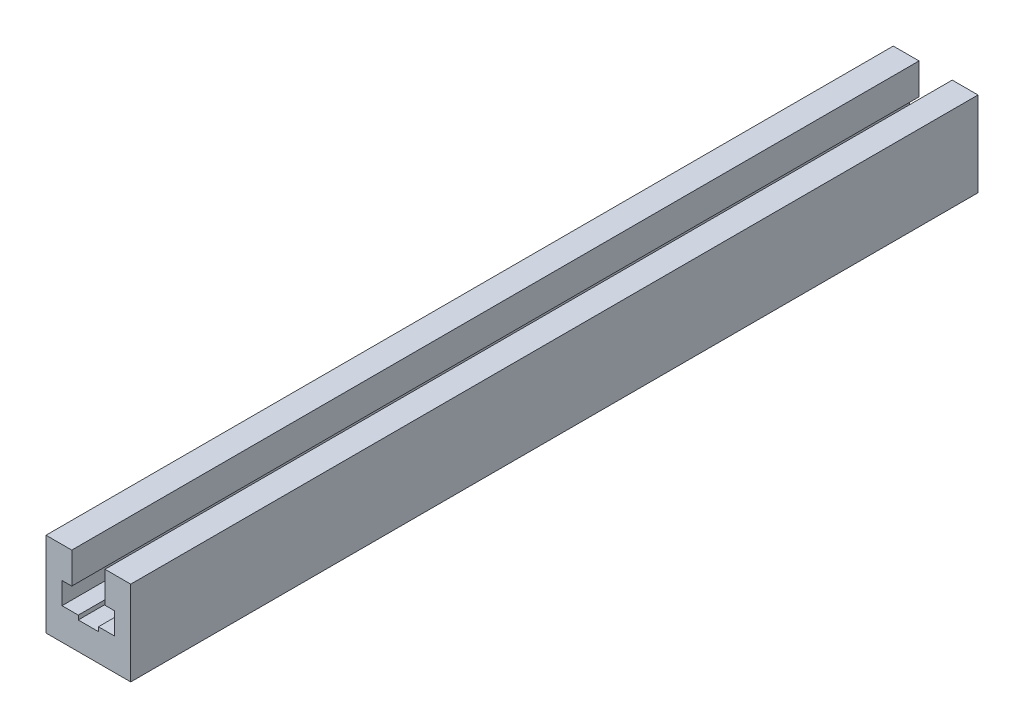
ISO-10303-21;
HEADER;
FILE_DESCRIPTION(('STEP AP214'),'2;1');
FILE_NAME('part.step','',(''),(''),'','','');
FILE_SCHEMA(('AUTOMOTIVE_DESIGN { 1 0 10303 214 1 1 1 1 }'));
ENDSEC;
DATA;
#1=APPLICATION_CONTEXT('core data for automotive mechanical design processes');
#2=APPLICATION_PROTOCOL_DEFINITION('international standard','automotive_design',2000,#1);
#3=PRODUCT_CONTEXT('',#1,'mechanical');
#4=PRODUCT('Part','Part','',(#3));
#5=PRODUCT_RELATED_PRODUCT_CATEGORY('part','',(#4));
#6=PRODUCT_DEFINITION_FORMATION('','',#4);
#7=PRODUCT_DEFINITION_CONTEXT('part definition',#1,'design');
#8=PRODUCT_DEFINITION('design','',#6,#7);
#9=PRODUCT_DEFINITION_SHAPE('','',#8);
#10=(LENGTH_UNIT() NAMED_UNIT(*) SI_UNIT(.MILLI.,.METRE.));
#11=(NAMED_UNIT(*) PLANE_ANGLE_UNIT() SI_UNIT($,.RADIAN.));
#12=(NAMED_UNIT(*) SI_UNIT($,.STERADIAN.) SOLID_ANGLE_UNIT());
#13=UNCERTAINTY_MEASURE_WITH_UNIT(LENGTH_MEASURE(1.E-05),#10,'distance_accuracy_value','');
#14=(GEOMETRIC_REPRESENTATION_CONTEXT(3) GLOBAL_UNCERTAINTY_ASSIGNED_CONTEXT((#13)) GLOBAL_UNIT_ASSIGNED_CONTEXT((#10,
#11,#12)) REPRESENTATION_CONTEXT('',''));
#15=CARTESIAN_POINT('',(0.,0.,0.));
#16=DIRECTION('',(0.,0.,1.));
#17=DIRECTION('',(1.,0.,0.));
#18=AXIS2_PLACEMENT_3D('',#15,#16,#17);
#19=CARTESIAN_POINT('',(-15.55,18.7,0.));
#20=DIRECTION('',(0.,-1.,0.));
#21=DIRECTION('',(0.,0.,-1.));
#22=AXIS2_PLACEMENT_3D('',#19,#20,#21);
#23=PLANE('',#22);
#24=DIRECTION('',(1.,0.,0.));
#25=VECTOR('',#24,1.);
#26=CARTESIAN_POINT('',(-15.55,18.7,500.));
#27=LINE('',#26,#25);
#28=CARTESIAN_POINT('',(-15.55,18.7,500.));
#29=VERTEX_POINT('',#28);
#30=CARTESIAN_POINT('',(-5.95,18.7,500.));
#31=VERTEX_POINT('',#30);
#32=EDGE_CURVE('E183',#29,#31,#27,.T.);
#33=ORIENTED_EDGE('',*,*,#32,.T.);
#34=DIRECTION('',(0.,0.,1.));
#35=VECTOR('',#34,1.);
#36=CARTESIAN_POINT('',(-5.95,18.7,0.));
#37=LINE('',#36,#35);
#38=CARTESIAN_POINT('',(-5.95,18.7,0.));
#39=VERTEX_POINT('',#38);
#40=EDGE_CURVE('E155',#39,#31,#37,.T.);
#41=ORIENTED_EDGE('',*,*,#40,.F.);
#42=DIRECTION('',(1.,0.,0.));
#43=VECTOR('',#42,1.);
#44=CARTESIAN_POINT('',(-15.55,18.7,0.));
#45=LINE('',#44,#43);
#46=CARTESIAN_POINT('',(-15.55,18.7,0.));
#47=VERTEX_POINT('',#46);
#48=EDGE_CURVE('E146',#47,#39,#45,.T.);
#49=ORIENTED_EDGE('',*,*,#48,.F.);
#50=DIRECTION('',(0.,0.,1.));
#51=VECTOR('',#50,1.);
#52=CARTESIAN_POINT('',(-15.55,18.7,0.));
#53=LINE('',#52,#51);
#54=EDGE_CURVE('E247',#47,#29,#53,.T.);
#55=ORIENTED_EDGE('',*,*,#54,.T.);
#56=EDGE_LOOP('',(#33,#41,#49,#55));
#57=FACE_BOUND('',#56,.T.);
#58=ADVANCED_FACE('F14',(#57),#23,.F.);
#59=CARTESIAN_POINT('',(-25.,50.,0.));
#60=DIRECTION('',(-1.,0.,0.));
#61=DIRECTION('',(0.,0.,1.));
#62=AXIS2_PLACEMENT_3D('',#59,#60,#61);
#63=PLANE('',#62);
#64=DIRECTION('',(0.,0.,1.));
#65=VECTOR('',#64,1.);
#66=CARTESIAN_POINT('',(-25.,50.,0.));
#67=LINE('',#66,#65);
#68=CARTESIAN_POINT('',(-25.,50.,0.));
#69=VERTEX_POINT('',#68);
#70=CARTESIAN_POINT('',(-25.,50.,500.));
#71=VERTEX_POINT('',#70);
#72=EDGE_CURVE('E9',#69,#71,#67,.T.);
#73=ORIENTED_EDGE('',*,*,#72,.F.);
#74=DIRECTION('',(0.,-1.,0.));
#75=VECTOR('',#74,1.);
#76=CARTESIAN_POINT('',(-25.,50.,0.));
#77=LINE('',#76,#75);
#78=CARTESIAN_POINT('',(-25.,0.,0.));
#79=VERTEX_POINT('',#78);
#80=EDGE_CURVE('E198',#69,#79,#77,.T.);
#81=ORIENTED_EDGE('',*,*,#80,.T.);
#82=DIRECTION('',(0.,0.,1.));
#83=VECTOR('',#82,1.);
#84=CARTESIAN_POINT('',(-25.,0.,0.));
#85=LINE('',#84,#83);
#86=CARTESIAN_POINT('',(-25.,0.,500.));
#87=VERTEX_POINT('',#86);
#88=EDGE_CURVE('E232',#79,#87,#85,.T.);
#89=ORIENTED_EDGE('',*,*,#88,.T.);
#90=DIRECTION('',(0.,-1.,0.));
#91=VECTOR('',#90,1.);
#92=CARTESIAN_POINT('',(-25.,50.,500.));
#93=LINE('',#92,#91);
#94=EDGE_CURVE('E157',#71,#87,#93,.T.);
#95=ORIENTED_EDGE('',*,*,#94,.F.);
#96=EDGE_LOOP('',(#73,#81,#89,#95));
#97=FACE_BOUND('',#96,.T.);
#98=ADVANCED_FACE('F262',(#97),#63,.T.);
#99=CARTESIAN_POINT('',(-25.,50.,0.));
#100=DIRECTION('',(0.,-1.,0.));
#101=DIRECTION('',(0.,0.,-1.));
#102=AXIS2_PLACEMENT_3D('',#99,#100,#101);
#103=PLANE('',#102);
#104=DIRECTION('',(0.,0.,1.));
#105=VECTOR('',#104,1.);
#106=CARTESIAN_POINT('',(-9.8,50.,0.));
#107=LINE('',#106,#105);
#108=CARTESIAN_POINT('',(-9.8,50.,0.));
#109=VERTEX_POINT('',#108);
#110=CARTESIAN_POINT('',(-9.8,50.,500.));
#111=VERTEX_POINT('',#110);
#112=EDGE_CURVE('E22',#109,#111,#107,.T.);
#113=ORIENTED_EDGE('',*,*,#112,.F.);
#114=DIRECTION('',(1.,0.,0.));
#115=VECTOR('',#114,1.);
#116=CARTESIAN_POINT('',(-25.,50.,0.));
#117=LINE('',#116,#115);
#118=EDGE_CURVE('E229',#69,#109,#117,.T.);
#119=ORIENTED_EDGE('',*,*,#118,.F.);
#120=ORIENTED_EDGE('',*,*,#72,.T.);
#121=DIRECTION('',(1.,0.,0.));
#122=VECTOR('',#121,1.);
#123=CARTESIAN_POINT('',(-25.,50.,500.));
#124=LINE('',#123,#122);
#125=EDGE_CURVE('E195',#71,#111,#124,.T.);
#126=ORIENTED_EDGE('',*,*,#125,.T.);
#127=EDGE_LOOP('',(#113,#119,#120,#126));
#128=FACE_BOUND('',#127,.T.);
#129=ADVANCED_FACE('F16',(#128),#103,.F.);
#130=CARTESIAN_POINT('',(-9.8,31.6,0.));
#131=DIRECTION('',(1.,0.,0.));
#132=DIRECTION('',(0.,0.,-1.));
#133=AXIS2_PLACEMENT_3D('',#130,#131,#132);
#134=PLANE('',#133);
#135=DIRECTION('',(0.,0.,1.));
#136=VECTOR('',#135,1.);
#137=CARTESIAN_POINT('',(-9.8,31.6,0.));
#138=LINE('',#137,#136);
#139=CARTESIAN_POINT('',(-9.8,31.6,0.));
#140=VERTEX_POINT('',#139);
#141=CARTESIAN_POINT('',(-9.8,31.6,500.));
#142=VERTEX_POINT('',#141);
#143=EDGE_CURVE('E251',#140,#142,#138,.T.);
#144=ORIENTED_EDGE('',*,*,#143,.F.);
#145=DIRECTION('',(0.,1.,0.));
#146=VECTOR('',#145,1.);
#147=CARTESIAN_POINT('',(-9.8,31.6,0.));
#148=LINE('',#147,#146);
#149=EDGE_CURVE('E226',#140,#109,#148,.T.);
#150=ORIENTED_EDGE('',*,*,#149,.T.);
#151=ORIENTED_EDGE('',*,*,#112,.T.);
#152=DIRECTION('',(0.,1.,0.));
#153=VECTOR('',#152,1.);
#154=CARTESIAN_POINT('',(-9.8,31.6,500.));
#155=LINE('',#154,#153);
#156=EDGE_CURVE('E192',#142,#111,#155,.T.);
#157=ORIENTED_EDGE('',*,*,#156,.F.);
#158=EDGE_LOOP('',(#144,#150,#151,#157));
#159=FACE_BOUND('',#158,.T.);
#160=ADVANCED_FACE('F254',(#159),#134,.T.);
#161=CARTESIAN_POINT('',(-15.55,31.6,0.));
#162=DIRECTION('',(0.,-1.,0.));
#163=DIRECTION('',(0.,0.,-1.));
#164=AXIS2_PLACEMENT_3D('',#161,#162,#163);
#165=PLANE('',#164);
#166=DIRECTION('',(0.,0.,1.));
#167=VECTOR('',#166,1.);
#168=CARTESIAN_POINT('',(-15.55,31.6,0.));
#169=LINE('',#168,#167);
#170=CARTESIAN_POINT('',(-15.55,31.6,0.));
#171=VERTEX_POINT('',#170);
#172=CARTESIAN_POINT('',(-15.55,31.6,500.));
#173=VERTEX_POINT('',#172);
#174=EDGE_CURVE('E249',#171,#173,#169,.T.);
#175=ORIENTED_EDGE('',*,*,#174,.F.);
#176=DIRECTION('',(1.,0.,0.));
#177=VECTOR('',#176,1.);
#178=CARTESIAN_POINT('',(-15.55,31.6,0.));
#179=LINE('',#178,#177);
#180=EDGE_CURVE('E223',#171,#140,#179,.T.);
#181=ORIENTED_EDGE('',*,*,#180,.T.);
#182=ORIENTED_EDGE('',*,*,#143,.T.);
#183=DIRECTION('',(1.,0.,0.));
#184=VECTOR('',#183,1.);
#185=CARTESIAN_POINT('',(-15.55,31.6,500.));
#186=LINE('',#185,#184);
#187=EDGE_CURVE('E189',#173,#142,#186,.T.);
#188=ORIENTED_EDGE('',*,*,#187,.F.);
#189=EDGE_LOOP('',(#175,#181,#182,#188));
#190=FACE_BOUND('',#189,.T.);
#191=ADVANCED_FACE('F297',(#190),#165,.T.);
#192=CARTESIAN_POINT('',(-15.55,18.7,0.));
#193=DIRECTION('',(1.,0.,0.));
#194=DIRECTION('',(0.,0.,-1.));
#195=AXIS2_PLACEMENT_3D('',#192,#193,#194);
#196=PLANE('',#195);
#197=ORIENTED_EDGE('',*,*,#54,.F.);
#198=DIRECTION('',(0.,1.,0.));
#199=VECTOR('',#198,1.);
#200=CARTESIAN_POINT('',(-15.55,18.7,0.));
#201=LINE('',#200,#199);
#202=EDGE_CURVE('E220',#47,#171,#201,.T.);
#203=ORIENTED_EDGE('',*,*,#202,.T.);
#204=ORIENTED_EDGE('',*,*,#174,.T.);
#205=DIRECTION('',(0.,1.,0.));
#206=VECTOR('',#205,1.);
#207=CARTESIAN_POINT('',(-15.55,18.7,500.));
#208=LINE('',#207,#206);
#209=EDGE_CURVE('E186',#29,#173,#208,.T.);
#210=ORIENTED_EDGE('',*,*,#209,.F.);
#211=EDGE_LOOP('',(#197,#203,#204,#210));
#212=FACE_BOUND('',#211,.T.);
#213=ADVANCED_FACE('F300',(#212),#196,.T.);
#214=CARTESIAN_POINT('',(5.95,18.7,0.));
#215=VERTEX_POINT('',#214);
#216=CARTESIAN_POINT('',(15.55,18.7,0.));
#217=VERTEX_POINT('',#216);
#218=EDGE_CURVE('E218',#215,#217,#45,.T.);
#219=ORIENTED_EDGE('',*,*,#218,.F.);
#220=DIRECTION('',(0.,0.,1.));
#221=VECTOR('',#220,1.);
#222=CARTESIAN_POINT('',(5.95,18.7,0.));
#223=LINE('',#222,#221);
#224=CARTESIAN_POINT('',(5.95,18.7,500.));
#225=VERTEX_POINT('',#224);
#226=EDGE_CURVE('E158',#215,#225,#223,.T.);
#227=ORIENTED_EDGE('',*,*,#226,.T.);
#228=CARTESIAN_POINT('',(15.55,18.7,500.));
#229=VERTEX_POINT('',#228);
#230=EDGE_CURVE('E182',#225,#229,#27,.T.);
#231=ORIENTED_EDGE('',*,*,#230,.T.);
#232=DIRECTION('',(0.,0.,1.));
#233=VECTOR('',#232,1.);
#234=CARTESIAN_POINT('',(15.55,18.7,0.));
#235=LINE('',#234,#233);
#236=EDGE_CURVE('E244',#217,#229,#235,.T.);
#237=ORIENTED_EDGE('',*,*,#236,.F.);
#238=EDGE_LOOP('',(#219,#227,#231,#237));
#239=FACE_BOUND('',#238,.T.);
#240=ADVANCED_FACE('F292',(#239),#23,.F.);
#241=CARTESIAN_POINT('',(15.55,18.7,0.));
#242=DIRECTION('',(1.,0.,0.));
#243=DIRECTION('',(0.,1.,0.));
#244=AXIS2_PLACEMENT_3D('',#241,#242,#243);
#245=PLANE('',#244);
#246=DIRECTION('',(0.,0.,1.));
#247=VECTOR('',#246,1.);
#248=CARTESIAN_POINT('',(15.55,31.6,0.));
#249=LINE('',#248,#247);
#250=CARTESIAN_POINT('',(15.55,31.6,0.));
#251=VERTEX_POINT('',#250);
#252=CARTESIAN_POINT('',(15.55,31.6,500.));
#253=VERTEX_POINT('',#252);
#254=EDGE_CURVE('E242',#251,#253,#249,.T.);
#255=ORIENTED_EDGE('',*,*,#254,.F.);
#256=DIRECTION('',(0.,1.,0.));
#257=VECTOR('',#256,1.);
#258=CARTESIAN_POINT('',(15.55,18.7,0.));
#259=LINE('',#258,#257);
#260=EDGE_CURVE('E215',#217,#251,#259,.T.);
#261=ORIENTED_EDGE('',*,*,#260,.F.);
#262=ORIENTED_EDGE('',*,*,#236,.T.);
#263=DIRECTION('',(0.,1.,0.));
#264=VECTOR('',#263,1.);
#265=CARTESIAN_POINT('',(15.55,18.7,500.));
#266=LINE('',#265,#264);
#267=EDGE_CURVE('E179',#229,#253,#266,.T.);
#268=ORIENTED_EDGE('',*,*,#267,.T.);
#269=EDGE_LOOP('',(#255,#261,#262,#268));
#270=FACE_BOUND('',#269,.T.);
#271=ADVANCED_FACE('F286',(#270),#245,.F.);
#272=CARTESIAN_POINT('',(9.8,31.6,0.));
#273=DIRECTION('',(0.,-1.,0.));
#274=DIRECTION('',(0.,0.,-1.));
#275=AXIS2_PLACEMENT_3D('',#272,#273,#274);
#276=PLANE('',#275);
#277=DIRECTION('',(0.,0.,1.));
#278=VECTOR('',#277,1.);
#279=CARTESIAN_POINT('',(9.8,31.6,0.));
#280=LINE('',#279,#278);
#281=CARTESIAN_POINT('',(9.8,31.6,0.));
#282=VERTEX_POINT('',#281);
#283=CARTESIAN_POINT('',(9.8,31.6,500.));
#284=VERTEX_POINT('',#283);
#285=EDGE_CURVE('E240',#282,#284,#280,.T.);
#286=ORIENTED_EDGE('',*,*,#285,.F.);
#287=DIRECTION('',(1.,0.,0.));
#288=VECTOR('',#287,1.);
#289=CARTESIAN_POINT('',(9.8,31.6,0.));
#290=LINE('',#289,#288);
#291=EDGE_CURVE('E212',#282,#251,#290,.T.);
#292=ORIENTED_EDGE('',*,*,#291,.T.);
#293=ORIENTED_EDGE('',*,*,#254,.T.);
#294=DIRECTION('',(1.,0.,0.));
#295=VECTOR('',#294,1.);
#296=CARTESIAN_POINT('',(9.8,31.6,500.));
#297=LINE('',#296,#295);
#298=EDGE_CURVE('E176',#284,#253,#297,.T.);
#299=ORIENTED_EDGE('',*,*,#298,.F.);
#300=EDGE_LOOP('',(#286,#292,#293,#299));
#301=FACE_BOUND('',#300,.T.);
#302=ADVANCED_FACE('F283',(#301),#276,.T.);
#303=CARTESIAN_POINT('',(9.8,31.6,0.));
#304=DIRECTION('',(1.,0.,0.));
#305=DIRECTION('',(0.,0.,-1.));
#306=AXIS2_PLACEMENT_3D('',#303,#304,#305);
#307=PLANE('',#306);
#308=DIRECTION('',(0.,0.,1.));
#309=VECTOR('',#308,1.);
#310=CARTESIAN_POINT('',(9.8,50.,0.));
#311=LINE('',#310,#309);
#312=CARTESIAN_POINT('',(9.8,50.,0.));
#313=VERTEX_POINT('',#312);
#314=CARTESIAN_POINT('',(9.8,50.,500.));
#315=VERTEX_POINT('',#314);
#316=EDGE_CURVE('E238',#313,#315,#311,.T.);
#317=ORIENTED_EDGE('',*,*,#316,.F.);
#318=DIRECTION('',(0.,1.,0.));
#319=VECTOR('',#318,1.);
#320=CARTESIAN_POINT('',(9.8,31.6,0.));
#321=LINE('',#320,#319);
#322=EDGE_CURVE('E209',#282,#313,#321,.T.);
#323=ORIENTED_EDGE('',*,*,#322,.F.);
#324=ORIENTED_EDGE('',*,*,#285,.T.);
#325=DIRECTION('',(0.,1.,0.));
#326=VECTOR('',#325,1.);
#327=CARTESIAN_POINT('',(9.8,31.6,500.));
#328=LINE('',#327,#326);
#329=EDGE_CURVE('E173',#284,#315,#328,.T.);
#330=ORIENTED_EDGE('',*,*,#329,.T.);
#331=EDGE_LOOP('',(#317,#323,#324,#330));
#332=FACE_BOUND('',#331,.T.);
#333=ADVANCED_FACE('F278',(#332),#307,.F.);
#334=CARTESIAN_POINT('',(9.8,50.,0.));
#335=DIRECTION('',(0.,-1.,0.));
#336=DIRECTION('',(0.,0.,-1.));
#337=AXIS2_PLACEMENT_3D('',#334,#335,#336);
#338=PLANE('',#337);
#339=DIRECTION('',(0.,0.,1.));
#340=VECTOR('',#339,1.);
#341=CARTESIAN_POINT('',(25.,50.,0.));
#342=LINE('',#341,#340);
#343=CARTESIAN_POINT('',(25.,50.,0.));
#344=VERTEX_POINT('',#343);
#345=CARTESIAN_POINT('',(25.,50.,500.));
#346=VERTEX_POINT('',#345);
#347=EDGE_CURVE('E236',#344,#346,#342,.T.);
#348=ORIENTED_EDGE('',*,*,#347,.F.);
#349=DIRECTION('',(1.,0.,0.));
#350=VECTOR('',#349,1.);
#351=CARTESIAN_POINT('',(9.8,50.,0.));
#352=LINE('',#351,#350);
#353=EDGE_CURVE('E206',#313,#344,#352,.T.);
#354=ORIENTED_EDGE('',*,*,#353,.F.);
#355=ORIENTED_EDGE('',*,*,#316,.T.);
#356=DIRECTION('',(1.,0.,0.));
#357=VECTOR('',#356,1.);
#358=CARTESIAN_POINT('',(9.8,50.,500.));
#359=LINE('',#358,#357);
#360=EDGE_CURVE('E170',#315,#346,#359,.T.);
#361=ORIENTED_EDGE('',*,*,#360,.T.);
#362=EDGE_LOOP('',(#348,#354,#355,#361));
#363=FACE_BOUND('',#362,.T.);
#364=ADVANCED_FACE('F274',(#363),#338,.F.);
#365=CARTESIAN_POINT('',(25.,50.,0.));
#366=DIRECTION('',(-1.,0.,0.));
#367=DIRECTION('',(0.,0.,1.));
#368=AXIS2_PLACEMENT_3D('',#365,#366,#367);
#369=PLANE('',#368);
#370=DIRECTION('',(0.,0.,1.));
#371=VECTOR('',#370,1.);
#372=CARTESIAN_POINT('',(25.,0.,0.));
#373=LINE('',#372,#371);
#374=CARTESIAN_POINT('',(25.,0.,0.));
#375=VERTEX_POINT('',#374);
#376=CARTESIAN_POINT('',(25.,0.,500.));
#377=VERTEX_POINT('',#376);
#378=EDGE_CURVE('E234',#375,#377,#373,.T.);
#379=ORIENTED_EDGE('',*,*,#378,.F.);
#380=DIRECTION('',(0.,-1.,0.));
#381=VECTOR('',#380,1.);
#382=CARTESIAN_POINT('',(25.,50.,0.));
#383=LINE('',#382,#381);
#384=EDGE_CURVE('E203',#344,#375,#383,.T.);
#385=ORIENTED_EDGE('',*,*,#384,.F.);
#386=ORIENTED_EDGE('',*,*,#347,.T.);
#387=DIRECTION('',(0.,-1.,0.));
#388=VECTOR('',#387,1.);
#389=CARTESIAN_POINT('',(25.,50.,500.));
#390=LINE('',#389,#388);
#391=EDGE_CURVE('E167',#346,#377,#390,.T.);
#392=ORIENTED_EDGE('',*,*,#391,.T.);
#393=EDGE_LOOP('',(#379,#385,#386,#392));
#394=FACE_BOUND('',#393,.T.);
#395=ADVANCED_FACE('F270',(#394),#369,.F.);
#396=CARTESIAN_POINT('',(-25.,0.,0.));
#397=DIRECTION('',(0.,-1.,0.));
#398=DIRECTION('',(0.,0.,-1.));
#399=AXIS2_PLACEMENT_3D('',#396,#397,#398);
#400=PLANE('',#399);
#401=DIRECTION('',(1.,0.,0.));
#402=VECTOR('',#401,1.);
#403=CARTESIAN_POINT('',(-25.,0.,0.));
#404=LINE('',#403,#402);
#405=EDGE_CURVE('E200',#79,#375,#404,.T.);
#406=ORIENTED_EDGE('',*,*,#405,.T.);
#407=ORIENTED_EDGE('',*,*,#378,.T.);
#408=DIRECTION('',(1.,0.,0.));
#409=VECTOR('',#408,1.);
#410=CARTESIAN_POINT('',(-25.,0.,500.));
#411=LINE('',#410,#409);
#412=EDGE_CURVE('E164',#87,#377,#411,.T.);
#413=ORIENTED_EDGE('',*,*,#412,.F.);
#414=ORIENTED_EDGE('',*,*,#88,.F.);
#415=EDGE_LOOP('',(#406,#407,#413,#414));
#416=FACE_BOUND('',#415,.T.);
#417=ADVANCED_FACE('F266',(#416),#400,.T.);
#418=CARTESIAN_POINT('',(-25.,0.,0.));
#419=DIRECTION('',(0.,0.,1.));
#420=DIRECTION('',(1.,0.,0.));
#421=AXIS2_PLACEMENT_3D('',#418,#419,#420);
#422=PLANE('',#421);
#423=ORIENTED_EDGE('',*,*,#48,.T.);
#424=DIRECTION('',(0.,-1.,0.));
#425=VECTOR('',#424,1.);
#426=CARTESIAN_POINT('',(-5.95,18.7,0.));
#427=LINE('',#426,#425);
#428=CARTESIAN_POINT('',(-5.95,16.2,0.));
#429=VERTEX_POINT('',#428);
#430=EDGE_CURVE('E127',#39,#429,#427,.T.);
#431=ORIENTED_EDGE('',*,*,#430,.T.);
#432=DIRECTION('',(1.,0.,0.));
#433=VECTOR('',#432,1.);
#434=CARTESIAN_POINT('',(-5.95,16.2,0.));
#435=LINE('',#434,#433);
#436=CARTESIAN_POINT('',(5.95,16.2,0.));
#437=VERTEX_POINT('',#436);
#438=EDGE_CURVE('E136',#429,#437,#435,.T.);
#439=ORIENTED_EDGE('',*,*,#438,.T.);
#440=DIRECTION('',(0.,1.,0.));
#441=VECTOR('',#440,1.);
#442=CARTESIAN_POINT('',(5.95,18.7,0.));
#443=LINE('',#442,#441);
#444=EDGE_CURVE('E133',#437,#215,#443,.T.);
#445=ORIENTED_EDGE('',*,*,#444,.T.);
#446=ORIENTED_EDGE('',*,*,#218,.T.);
#447=ORIENTED_EDGE('',*,*,#260,.T.);
#448=ORIENTED_EDGE('',*,*,#291,.F.);
#449=ORIENTED_EDGE('',*,*,#322,.T.);
#450=ORIENTED_EDGE('',*,*,#353,.T.);
#451=ORIENTED_EDGE('',*,*,#384,.T.);
#452=ORIENTED_EDGE('',*,*,#405,.F.);
#453=ORIENTED_EDGE('',*,*,#80,.F.);
#454=ORIENTED_EDGE('',*,*,#118,.T.);
#455=ORIENTED_EDGE('',*,*,#149,.F.);
#456=ORIENTED_EDGE('',*,*,#180,.F.);
#457=ORIENTED_EDGE('',*,*,#202,.F.);
#458=EDGE_LOOP('',(#423,#431,#439,#445,#446,#447,#448,#449,#450,#451,#452,#453,#454,#455,#456,#457));
#459=FACE_BOUND('',#458,.T.);
#460=ADVANCED_FACE('F143',(#459),#422,.F.);
#461=CARTESIAN_POINT('',(-25.,0.,500.));
#462=DIRECTION('',(0.,0.,1.));
#463=DIRECTION('',(1.,0.,0.));
#464=AXIS2_PLACEMENT_3D('',#461,#462,#463);
#465=PLANE('',#464);
#466=DIRECTION('',(0.,-1.,0.));
#467=VECTOR('',#466,1.);
#468=CARTESIAN_POINT('',(-5.95,18.7,500.));
#469=LINE('',#468,#467);
#470=CARTESIAN_POINT('',(-5.95,16.2,500.));
#471=VERTEX_POINT('',#470);
#472=EDGE_CURVE('E29',#31,#471,#469,.T.);
#473=ORIENTED_EDGE('',*,*,#472,.F.);
#474=ORIENTED_EDGE('',*,*,#32,.F.);
#475=ORIENTED_EDGE('',*,*,#209,.T.);
#476=ORIENTED_EDGE('',*,*,#187,.T.);
#477=ORIENTED_EDGE('',*,*,#156,.T.);
#478=ORIENTED_EDGE('',*,*,#125,.F.);
#479=ORIENTED_EDGE('',*,*,#94,.T.);
#480=ORIENTED_EDGE('',*,*,#412,.T.);
#481=ORIENTED_EDGE('',*,*,#391,.F.);
#482=ORIENTED_EDGE('',*,*,#360,.F.);
#483=ORIENTED_EDGE('',*,*,#329,.F.);
#484=ORIENTED_EDGE('',*,*,#298,.T.);
#485=ORIENTED_EDGE('',*,*,#267,.F.);
#486=ORIENTED_EDGE('',*,*,#230,.F.);
#487=DIRECTION('',(0.,1.,0.));
#488=VECTOR('',#487,1.);
#489=CARTESIAN_POINT('',(5.95,18.7,500.));
#490=LINE('',#489,#488);
#491=CARTESIAN_POINT('',(5.95,16.2,500.));
#492=VERTEX_POINT('',#491);
#493=EDGE_CURVE('E147',#492,#225,#490,.T.);
#494=ORIENTED_EDGE('',*,*,#493,.F.);
#495=DIRECTION('',(1.,0.,0.));
#496=VECTOR('',#495,1.);
#497=CARTESIAN_POINT('',(-5.95,16.2,500.));
#498=LINE('',#497,#496);
#499=EDGE_CURVE('E149',#471,#492,#498,.T.);
#500=ORIENTED_EDGE('',*,*,#499,.F.);
#501=EDGE_LOOP('',(#473,#474,#475,#476,#477,#478,#479,#480,#481,#482,#483,#484,#485,#486,#494,#500));
#502=FACE_BOUND('',#501,.T.);
#503=ADVANCED_FACE('F260',(#502),#465,.T.);
#504=CARTESIAN_POINT('',(-5.95,18.7,0.));
#505=DIRECTION('',(-1.,0.,0.));
#506=DIRECTION('',(0.,-1.,0.));
#507=AXIS2_PLACEMENT_3D('',#504,#505,#506);
#508=PLANE('',#507);
#509=ORIENTED_EDGE('',*,*,#472,.T.);
#510=DIRECTION('',(0.,0.,1.));
#511=VECTOR('',#510,1.);
#512=CARTESIAN_POINT('',(-5.95,16.2,0.));
#513=LINE('',#512,#511);
#514=EDGE_CURVE('E123',#429,#471,#513,.T.);
#515=ORIENTED_EDGE('',*,*,#514,.F.);
#516=ORIENTED_EDGE('',*,*,#430,.F.);
#517=ORIENTED_EDGE('',*,*,#40,.T.);
#518=EDGE_LOOP('',(#509,#515,#516,#517));
#519=FACE_BOUND('',#518,.T.);
#520=ADVANCED_FACE('F125',(#519),#508,.F.);
#521=CARTESIAN_POINT('',(5.95,18.7,0.));
#522=DIRECTION('',(1.,0.,0.));
#523=DIRECTION('',(0.,0.,-1.));
#524=AXIS2_PLACEMENT_3D('',#521,#522,#523);
#525=PLANE('',#524);
#526=ORIENTED_EDGE('',*,*,#493,.T.);
#527=ORIENTED_EDGE('',*,*,#226,.F.);
#528=ORIENTED_EDGE('',*,*,#444,.F.);
#529=DIRECTION('',(0.,0.,1.));
#530=VECTOR('',#529,1.);
#531=CARTESIAN_POINT('',(5.95,16.2,0.));
#532=LINE('',#531,#530);
#533=EDGE_CURVE('E132',#437,#492,#532,.T.);
#534=ORIENTED_EDGE('',*,*,#533,.T.);
#535=EDGE_LOOP('',(#526,#527,#528,#534));
#536=FACE_BOUND('',#535,.T.);
#537=ADVANCED_FACE('F294',(#536),#525,.F.);
#538=CARTESIAN_POINT('',(-5.95,16.2,0.));
#539=DIRECTION('',(0.,-1.,0.));
#540=DIRECTION('',(0.,0.,-1.));
#541=AXIS2_PLACEMENT_3D('',#538,#539,#540);
#542=PLANE('',#541);
#543=ORIENTED_EDGE('',*,*,#499,.T.);
#544=ORIENTED_EDGE('',*,*,#533,.F.);
#545=ORIENTED_EDGE('',*,*,#438,.F.);
#546=ORIENTED_EDGE('',*,*,#514,.T.);
#547=EDGE_LOOP('',(#543,#544,#545,#546));
#548=FACE_BOUND('',#547,.T.);
#549=ADVANCED_FACE('F137',(#548),#542,.F.);
#550=CLOSED_SHELL('',(#58,#98,#129,#160,#191,#213,#240,#271,#302,#333,#364,#395,#417,#460,#503,
#520,#537,#549));
#551=MANIFOLD_SOLID_BREP('B1',#550);
#552=ADVANCED_BREP_SHAPE_REPRESENTATION('',(#18,#551),#14);
#553=SHAPE_DEFINITION_REPRESENTATION(#9,#552);
ENDSEC;
END-ISO-10303-21;
